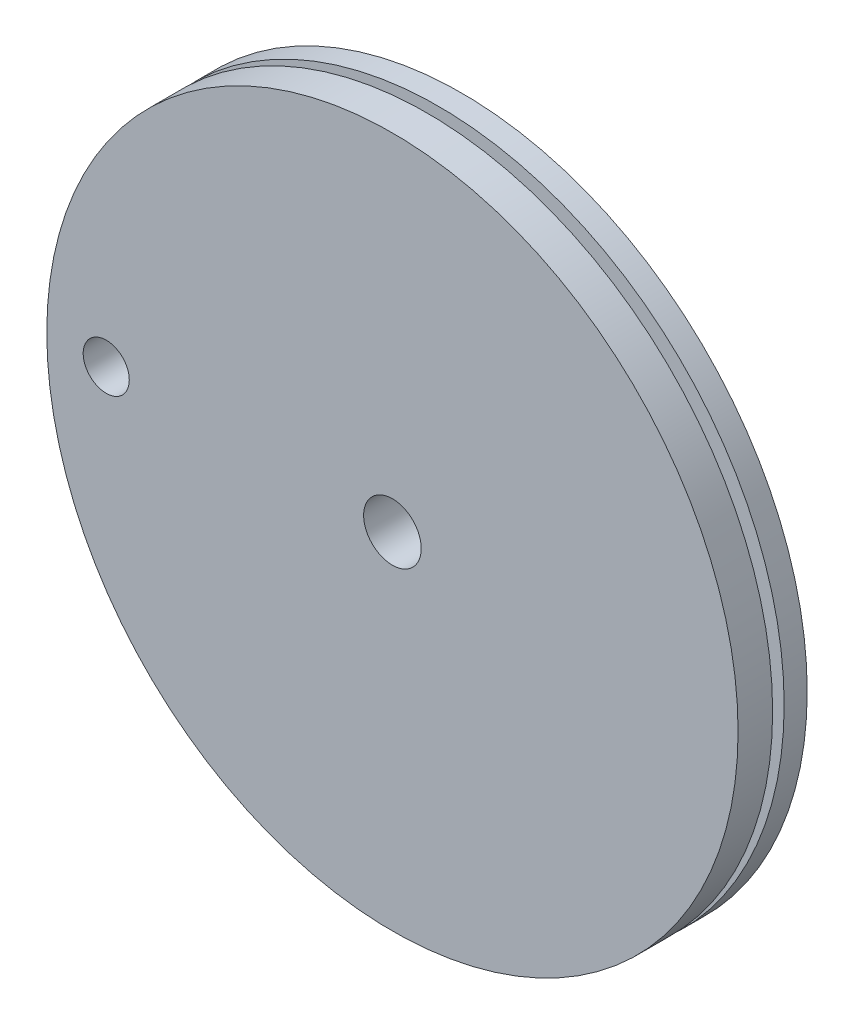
ISO-10303-21;
HEADER;
FILE_DESCRIPTION(('STEP AP214'),'2;1');
FILE_NAME('part.step','',(''),(''),'','','');
FILE_SCHEMA(('AUTOMOTIVE_DESIGN { 1 0 10303 214 1 1 1 1 }'));
ENDSEC;
DATA;
#1=APPLICATION_CONTEXT('core data for automotive mechanical design processes');
#2=APPLICATION_PROTOCOL_DEFINITION('international standard','automotive_design',2000,#1);
#3=PRODUCT_CONTEXT('',#1,'mechanical');
#4=PRODUCT('Part','Part','',(#3));
#5=PRODUCT_RELATED_PRODUCT_CATEGORY('part','',(#4));
#6=PRODUCT_DEFINITION_FORMATION('','',#4);
#7=PRODUCT_DEFINITION_CONTEXT('part definition',#1,'design');
#8=PRODUCT_DEFINITION('design','',#6,#7);
#9=PRODUCT_DEFINITION_SHAPE('','',#8);
#10=(LENGTH_UNIT() NAMED_UNIT(*) SI_UNIT(.MILLI.,.METRE.));
#11=(NAMED_UNIT(*) PLANE_ANGLE_UNIT() SI_UNIT($,.RADIAN.));
#12=(NAMED_UNIT(*) SI_UNIT($,.STERADIAN.) SOLID_ANGLE_UNIT());
#13=UNCERTAINTY_MEASURE_WITH_UNIT(LENGTH_MEASURE(1.E-05),#10,'distance_accuracy_value','');
#14=(GEOMETRIC_REPRESENTATION_CONTEXT(3) GLOBAL_UNCERTAINTY_ASSIGNED_CONTEXT((#13)) GLOBAL_UNIT_ASSIGNED_CONTEXT((#10,
#11,#12)) REPRESENTATION_CONTEXT('',''));
#15=CARTESIAN_POINT('',(0.,0.,0.));
#16=DIRECTION('',(0.,0.,1.));
#17=DIRECTION('',(1.,0.,0.));
#18=AXIS2_PLACEMENT_3D('',#15,#16,#17);
#19=CARTESIAN_POINT('',(0.,0.,3.));
#20=DIRECTION('',(0.,0.,-1.));
#21=DIRECTION('',(-1.,0.,0.));
#22=AXIS2_PLACEMENT_3D('',#19,#20,#21);
#23=CYLINDRICAL_SURFACE('',#22,30.);
#24=CARTESIAN_POINT('',(0.,0.,0.));
#25=DIRECTION('',(0.,0.,1.));
#26=DIRECTION('',(1.,0.,0.));
#27=AXIS2_PLACEMENT_3D('',#24,#25,#26);
#28=CIRCLE('',#27,30.);
#29=CARTESIAN_POINT('',(30.,0.,0.));
#30=VERTEX_POINT('',#29);
#31=EDGE_CURVE('E11',#30,#30,#28,.T.);
#32=ORIENTED_EDGE('',*,*,#31,.T.);
#33=EDGE_LOOP('',(#32));
#34=FACE_BOUND('',#33,.T.);
#35=CARTESIAN_POINT('',(0.,0.,2.));
#36=DIRECTION('',(0.,0.,1.));
#37=DIRECTION('',(1.,0.,0.));
#38=AXIS2_PLACEMENT_3D('',#35,#36,#37);
#39=CIRCLE('',#38,30.);
#40=CARTESIAN_POINT('',(30.,0.,2.));
#41=VERTEX_POINT('',#40);
#42=EDGE_CURVE('E33',#41,#41,#39,.T.);
#43=ORIENTED_EDGE('',*,*,#42,.F.);
#44=EDGE_LOOP('',(#43));
#45=FACE_BOUND('',#44,.T.);
#46=ADVANCED_FACE('F30',(#34,#45),#23,.T.);
#47=CARTESIAN_POINT('',(0.,0.,0.));
#48=DIRECTION('',(0.,0.,1.));
#49=DIRECTION('',(1.,0.,0.));
#50=AXIS2_PLACEMENT_3D('',#47,#48,#49);
#51=PLANE('',#50);
#52=CARTESIAN_POINT('',(-24.8397418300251,0.,0.));
#53=DIRECTION('',(0.,0.,1.));
#54=DIRECTION('',(1.,0.,0.));
#55=AXIS2_PLACEMENT_3D('',#52,#53,#54);
#56=CIRCLE('',#55,2.);
#57=CARTESIAN_POINT('',(-22.8397418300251,0.,0.));
#58=VERTEX_POINT('',#57);
#59=EDGE_CURVE('E59',#58,#58,#56,.T.);
#60=ORIENTED_EDGE('',*,*,#59,.T.);
#61=EDGE_LOOP('',(#60));
#62=FACE_BOUND('',#61,.T.);
#63=CARTESIAN_POINT('',(0.,0.,0.));
#64=DIRECTION('',(0.,0.,1.));
#65=DIRECTION('',(1.,0.,0.));
#66=AXIS2_PLACEMENT_3D('',#63,#64,#65);
#67=CIRCLE('',#66,2.5);
#68=CARTESIAN_POINT('',(2.5,0.,0.));
#69=VERTEX_POINT('',#68);
#70=EDGE_CURVE('E53',#69,#69,#67,.T.);
#71=ORIENTED_EDGE('',*,*,#70,.T.);
#72=EDGE_LOOP('',(#71));
#73=FACE_BOUND('',#72,.T.);
#74=ORIENTED_EDGE('',*,*,#31,.F.);
#75=EDGE_LOOP('',(#74));
#76=FACE_BOUND('',#75,.T.);
#77=ADVANCED_FACE('F95',(#62,#73,#76),#51,.F.);
#78=CARTESIAN_POINT('',(0.,0.,2.));
#79=DIRECTION('',(0.,0.,1.));
#80=DIRECTION('',(1.,0.,0.));
#81=AXIS2_PLACEMENT_3D('',#78,#79,#80);
#82=PLANE('',#81);
#83=CARTESIAN_POINT('',(0.,0.,2.));
#84=DIRECTION('',(0.,0.,1.));
#85=DIRECTION('',(1.,0.,0.));
#86=AXIS2_PLACEMENT_3D('',#83,#84,#85);
#87=CIRCLE('',#86,28.5);
#88=CARTESIAN_POINT('',(28.5,0.,2.));
#89=VERTEX_POINT('',#88);
#90=EDGE_CURVE('E40',#89,#89,#87,.T.);
#91=ORIENTED_EDGE('',*,*,#90,.F.);
#92=EDGE_LOOP('',(#91));
#93=FACE_BOUND('',#92,.T.);
#94=ORIENTED_EDGE('',*,*,#42,.T.);
#95=EDGE_LOOP('',(#94));
#96=FACE_BOUND('',#95,.T.);
#97=ADVANCED_FACE('F99',(#93,#96),#82,.T.);
#98=CARTESIAN_POINT('',(0.,0.,2.));
#99=DIRECTION('',(0.,0.,1.));
#100=DIRECTION('',(1.,0.,0.));
#101=AXIS2_PLACEMENT_3D('',#98,#99,#100);
#102=CYLINDRICAL_SURFACE('',#101,28.5);
#103=ORIENTED_EDGE('',*,*,#90,.T.);
#104=EDGE_LOOP('',(#103));
#105=FACE_BOUND('',#104,.T.);
#106=CARTESIAN_POINT('',(0.,0.,3.));
#107=DIRECTION('',(0.,0.,1.));
#108=DIRECTION('',(1.,0.,0.));
#109=AXIS2_PLACEMENT_3D('',#106,#107,#108);
#110=CIRCLE('',#109,28.5);
#111=CARTESIAN_POINT('',(28.5,0.,3.));
#112=VERTEX_POINT('',#111);
#113=EDGE_CURVE('E44',#112,#112,#110,.T.);
#114=ORIENTED_EDGE('',*,*,#113,.F.);
#115=EDGE_LOOP('',(#114));
#116=FACE_BOUND('',#115,.T.);
#117=ADVANCED_FACE('F80',(#105,#116),#102,.T.);
#118=CARTESIAN_POINT('',(0.,0.,6.));
#119=DIRECTION('',(0.,0.,-1.));
#120=DIRECTION('',(-1.,0.,0.));
#121=AXIS2_PLACEMENT_3D('',#118,#119,#120);
#122=CYLINDRICAL_SURFACE('',#121,30.);
#123=CARTESIAN_POINT('',(0.,0.,6.));
#124=DIRECTION('',(0.,0.,1.));
#125=DIRECTION('',(1.,0.,0.));
#126=AXIS2_PLACEMENT_3D('',#123,#124,#125);
#127=CIRCLE('',#126,30.);
#128=CARTESIAN_POINT('',(30.,0.,6.));
#129=VERTEX_POINT('',#128);
#130=EDGE_CURVE('E47',#129,#129,#127,.T.);
#131=ORIENTED_EDGE('',*,*,#130,.F.);
#132=EDGE_LOOP('',(#131));
#133=FACE_BOUND('',#132,.T.);
#134=CARTESIAN_POINT('',(0.,0.,3.));
#135=DIRECTION('',(0.,0.,1.));
#136=DIRECTION('',(1.,0.,0.));
#137=AXIS2_PLACEMENT_3D('',#134,#135,#136);
#138=CIRCLE('',#137,30.);
#139=CARTESIAN_POINT('',(30.,0.,3.));
#140=VERTEX_POINT('',#139);
#141=EDGE_CURVE('E50',#140,#140,#138,.T.);
#142=ORIENTED_EDGE('',*,*,#141,.T.);
#143=EDGE_LOOP('',(#142));
#144=FACE_BOUND('',#143,.T.);
#145=ADVANCED_FACE('F72',(#133,#144),#122,.T.);
#146=CARTESIAN_POINT('',(0.,0.,6.));
#147=DIRECTION('',(0.,0.,1.));
#148=DIRECTION('',(1.,0.,0.));
#149=AXIS2_PLACEMENT_3D('',#146,#147,#148);
#150=PLANE('',#149);
#151=CARTESIAN_POINT('',(-24.8397418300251,0.,6.));
#152=DIRECTION('',(0.,0.,1.));
#153=DIRECTION('',(1.,0.,0.));
#154=AXIS2_PLACEMENT_3D('',#151,#152,#153);
#155=CIRCLE('',#154,2.);
#156=CARTESIAN_POINT('',(-22.8397418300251,0.,6.));
#157=VERTEX_POINT('',#156);
#158=EDGE_CURVE('E62',#157,#157,#155,.T.);
#159=ORIENTED_EDGE('',*,*,#158,.F.);
#160=EDGE_LOOP('',(#159));
#161=FACE_BOUND('',#160,.T.);
#162=CARTESIAN_POINT('',(0.,0.,6.));
#163=DIRECTION('',(0.,0.,1.));
#164=DIRECTION('',(1.,0.,0.));
#165=AXIS2_PLACEMENT_3D('',#162,#163,#164);
#166=CIRCLE('',#165,2.5);
#167=CARTESIAN_POINT('',(2.5,0.,6.));
#168=VERTEX_POINT('',#167);
#169=EDGE_CURVE('E56',#168,#168,#166,.T.);
#170=ORIENTED_EDGE('',*,*,#169,.F.);
#171=EDGE_LOOP('',(#170));
#172=FACE_BOUND('',#171,.T.);
#173=ORIENTED_EDGE('',*,*,#130,.T.);
#174=EDGE_LOOP('',(#173));
#175=FACE_BOUND('',#174,.T.);
#176=ADVANCED_FACE('F68',(#161,#172,#175),#150,.T.);
#177=CARTESIAN_POINT('',(0.,0.,3.));
#178=DIRECTION('',(0.,0.,1.));
#179=DIRECTION('',(1.,0.,0.));
#180=AXIS2_PLACEMENT_3D('',#177,#178,#179);
#181=PLANE('',#180);
#182=ORIENTED_EDGE('',*,*,#113,.T.);
#183=EDGE_LOOP('',(#182));
#184=FACE_BOUND('',#183,.T.);
#185=ORIENTED_EDGE('',*,*,#141,.F.);
#186=EDGE_LOOP('',(#185));
#187=FACE_BOUND('',#186,.T.);
#188=ADVANCED_FACE('F71',(#184,#187),#181,.F.);
#189=CARTESIAN_POINT('',(0.,0.,0.));
#190=DIRECTION('',(0.,0.,1.));
#191=DIRECTION('',(1.,0.,0.));
#192=AXIS2_PLACEMENT_3D('',#189,#190,#191);
#193=CYLINDRICAL_SURFACE('',#192,2.5);
#194=ORIENTED_EDGE('',*,*,#70,.F.);
#195=EDGE_LOOP('',(#194));
#196=FACE_BOUND('',#195,.T.);
#197=ORIENTED_EDGE('',*,*,#169,.T.);
#198=EDGE_LOOP('',(#197));
#199=FACE_BOUND('',#198,.T.);
#200=ADVANCED_FACE('F85',(#196,#199),#193,.F.);
#201=CARTESIAN_POINT('',(-24.8397418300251,0.,0.));
#202=DIRECTION('',(0.,0.,1.));
#203=DIRECTION('',(1.,0.,0.));
#204=AXIS2_PLACEMENT_3D('',#201,#202,#203);
#205=CYLINDRICAL_SURFACE('',#204,2.);
#206=ORIENTED_EDGE('',*,*,#59,.F.);
#207=EDGE_LOOP('',(#206));
#208=FACE_BOUND('',#207,.T.);
#209=ORIENTED_EDGE('',*,*,#158,.T.);
#210=EDGE_LOOP('',(#209));
#211=FACE_BOUND('',#210,.T.);
#212=ADVANCED_FACE('F66',(#208,#211),#205,.F.);
#213=CLOSED_SHELL('',(#46,#77,#97,#117,#145,#176,#188,#200,#212));
#214=MANIFOLD_SOLID_BREP('B2',#213);
#215=ADVANCED_BREP_SHAPE_REPRESENTATION('',(#18,#214),#14);
#216=SHAPE_DEFINITION_REPRESENTATION(#9,#215);
ENDSEC;
END-ISO-10303-21;
